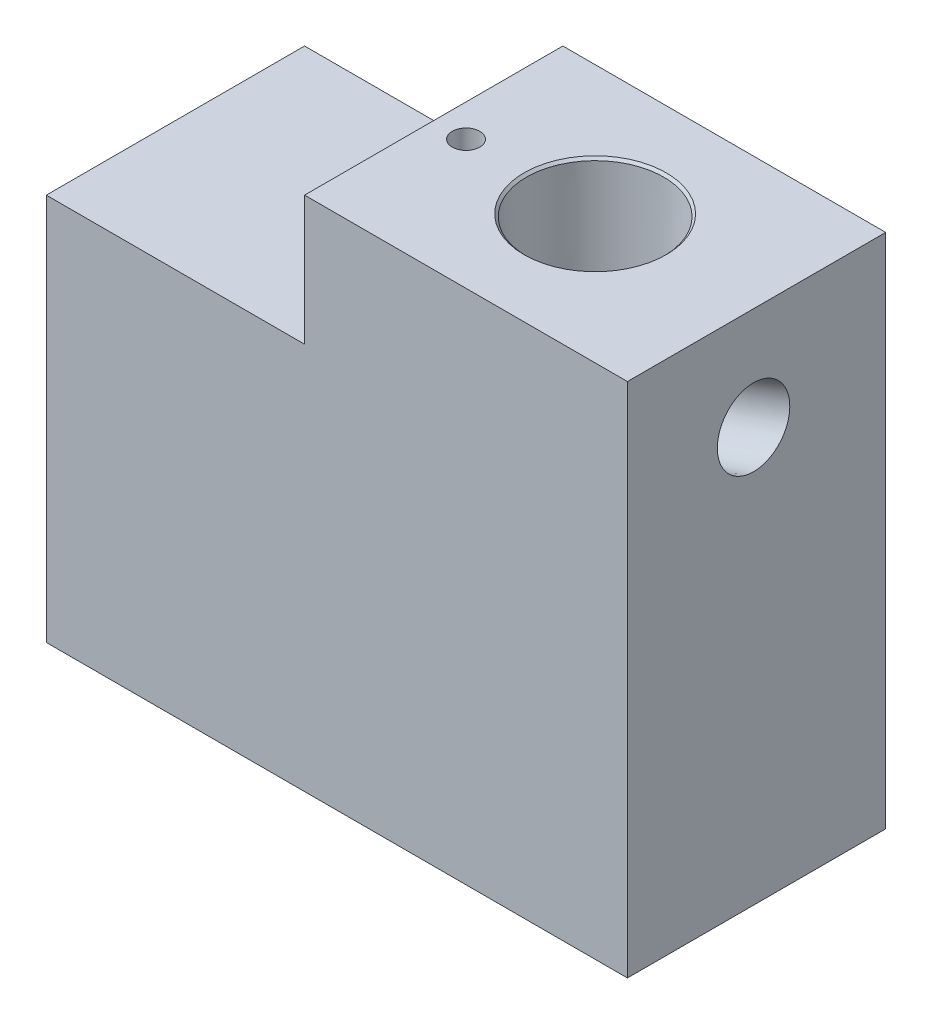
from build123d import *

# Parameters (mm, degrees)
SKETCH1_W                         = 114.3
SKETCH1_H                         = 50.8
BOSS_EXTRUDE1_DEPTH               = 101.6
F_3_8_NPT_TAPPED_HOLE1_AT_2_COUNT = 2
F_3_8_NPT_TAPPED_HOLE1_AT_2_PITCH = 31.75
SKETCH7_W                         = 50.8
SKETCH7_H                         = 50.8
CUT_EXTRUDE1_DEPTH                = 25.4
F_1_4_28_TAPPED_HOLE1_D           = 5.4102
F_1_4_28_TAPPED_HOLE1_DEPTH       = 12.7
F_1_4_28_TAPPED_HOLE1_TIP         = 1.625388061
CUT_EXTRUDE2_REACH                = 163.145
SKETCH10_R                        = 1.5875
F_10_32_TAPPED_HOLE1_D            = 4.0386
F_10_32_TAPPED_HOLE1_DEPTH        = 25.4
F_10_32_TAPPED_HOLE1_TIP          = 1.213317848


with BuildPart() as part:
    # Sketch1 → Boss-Extrude1 (new body)
    with BuildSketch(Plane(origin=(0, 0, 0), x_dir=(1, 0, 0), z_dir=(0, 1, 0))):
        with Locations((57.15, 25.4)):
            Rectangle(SKETCH1_W, SKETCH1_H)
    extrude(amount=BOSS_EXTRUDE1_DEPTH)

    # Sketch3 → 3_4 NPT Tapped Hole1 (revolve, cut)
    with BuildSketch(Plane(origin=(82.55, 101.6, -25.4), x_dir=(0, 0, 1), z_dir=(1, 0, 0))):
        Polygon((0, 0), (0, 37.393622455), (11.5062, 30.48), (11.5062, 19.05), (12.928744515, 19.05), (13.4845933, 0.4854067), (13.97, 0), align=None)
    revolve(axis=Axis((82.55, 107.95, -25.4), (0, -1, 0)), mode=Mode.SUBTRACT)

    # Sketch5 → 3_8 NPT Tapped Hole1 (revolve, cut)
    with BuildSketch(Plane(origin=(57.15, 0, -25.4), x_dir=(0, 0, -1), z_dir=(1, 0, 0))):
        Polygon((0, 0), (0, 62.708582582), (7.1374, 58.42), (7.1374, 19.05), (8.272498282, 19.05), (8.8335866, 0.3104134), (9.144, 0), align=None)
    f_3_8_npt_tapped_hole1 = revolve(axis=Axis((57.15, -6.35, -25.4), (0, 1, 0)), mode=Mode.SUBTRACT)

    # 3_8 NPT Tapped Hole1 at 2: 3_8 NPT Tapped Hole1 ×2
    with Locations(*[(-i * F_3_8_NPT_TAPPED_HOLE1_AT_2_PITCH, 0, 0) for i in range(1, F_3_8_NPT_TAPPED_HOLE1_AT_2_COUNT)]):
        add(f_3_8_npt_tapped_hole1, mode=Mode.SUBTRACT)

    # Sketch7 → Cut-Extrude1 (cut)
    with BuildSketch(Plane(origin=(0, 101.6, 0), x_dir=(1, 0, 0), z_dir=(0, 1, 0))):
        with Locations((25.4, 25.4)):
            Rectangle(SKETCH7_W, SKETCH7_H)
    extrude(amount=-CUT_EXTRUDE1_DEPTH, mode=Mode.SUBTRACT)

    # 1_4-28 Tapped Hole1
    with Locations(Plane(origin=(0, 101.6, 0), x_dir=(1, 0, 0), z_dir=(0, 1, 0))):
        with Locations((57.15, 25.4)):
            Hole(F_1_4_28_TAPPED_HOLE1_D / 2, depth=F_1_4_28_TAPPED_HOLE1_DEPTH)
            with Locations((0, 0, -(F_1_4_28_TAPPED_HOLE1_DEPTH + F_1_4_28_TAPPED_HOLE1_TIP / 2))):  # 118° drill point
                Cone(0, F_1_4_28_TAPPED_HOLE1_D / 2, F_1_4_28_TAPPED_HOLE1_TIP, mode=Mode.SUBTRACT)

    # Cut-Extrude2: up to this cone (the profile starts outside it)
    cut_extrude2_end = Plane(origin=(57.15, 101.6, -25.4), z_dir=(0, -1, 0)).offset(38.891418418) * Cone(1.664e-06, 207.624827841, 124.753581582, align=(Align.CENTER, Align.CENTER, Align.MIN), mode=Mode.PRIVATE)
    # Sketch10 → Cut-Extrude2 (cut, up to the surface)
    with BuildSketch(Plane(origin=(0, 101.6, 0), x_dir=(1, 0, 0), z_dir=(0, 1, 0)), mode=Mode.PRIVATE) as cut_extrude2_sk1:
        with Locations(Location((57.15, 25.4, 0), (0, 0, 270))):
            Circle(SKETCH10_R)
    cut_extrude2_tool1 = extrude(cut_extrude2_sk1.sketch, amount=-CUT_EXTRUDE2_REACH, mode=Mode.PRIVATE) - cut_extrude2_end
    add(cut_extrude2_tool1.solids().sort_by_distance((57.15, 101.6, -25.4))[0], mode=Mode.SUBTRACT)

    # Sketch22 → 1_4 NPT Tapped Hole3 (revolve, cut)
    with BuildSketch(Plane(origin=(120.81548373, 83.698855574, -24.810563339), x_dir=(-0.34202014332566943, 0.9396926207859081, 0), z_dir=(0, 0, 1))):
        Polygon((0, 0), (0, 104.942347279), (5.5626, 101.6), (5.5626, 25.4), (6.567006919, 25.4), (7.3184893, 0.3015107), (7.62, 0), align=None)
    revolve(axis=Axis((126.782531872, 85.870683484, -24.810563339), (-0.9396926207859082, -0.34202014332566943, 0)), mode=Mode.SUBTRACT)

    # 10-32 Tapped Hole1
    with Locations(Plane(origin=(0, 0, 0), x_dir=(-1, 0, 0), z_dir=(0, -1, 0))):
        with Locations((-9.039748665, 42.672000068), (-9.039748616, 8.128000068), (-102.36296883, 38.099999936), (-102.362968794, 12.699999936)):
            Hole(F_10_32_TAPPED_HOLE1_D / 2, depth=F_10_32_TAPPED_HOLE1_DEPTH)
            with Locations((0, 0, -(F_10_32_TAPPED_HOLE1_DEPTH + F_10_32_TAPPED_HOLE1_TIP / 2))):  # 118° drill point
                Cone(0, F_10_32_TAPPED_HOLE1_D / 2, F_10_32_TAPPED_HOLE1_TIP, mode=Mode.SUBTRACT)


solid = part.part
